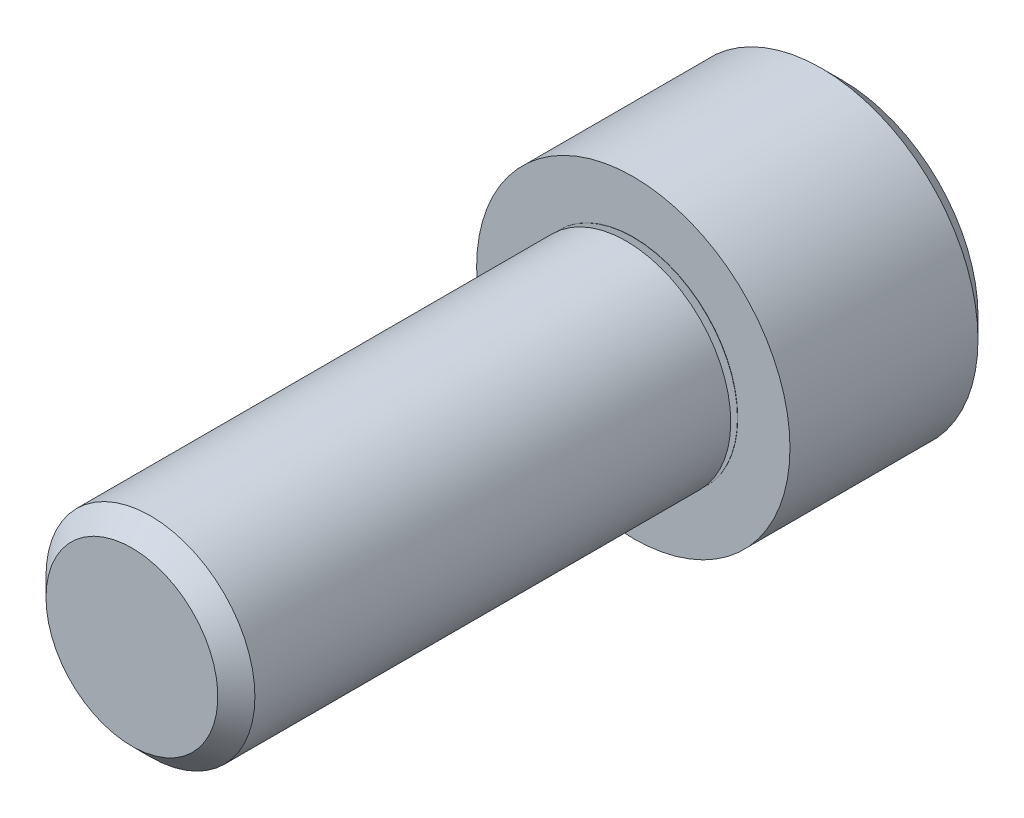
ISO-10303-21;
HEADER;
FILE_DESCRIPTION(('STEP AP214'),'2;1');
FILE_NAME('part.step','',(''),(''),'','','');
FILE_SCHEMA(('AUTOMOTIVE_DESIGN { 1 0 10303 214 1 1 1 1 }'));
ENDSEC;
DATA;
#1=APPLICATION_CONTEXT('core data for automotive mechanical design processes');
#2=APPLICATION_PROTOCOL_DEFINITION('international standard','automotive_design',2000,#1);
#3=PRODUCT_CONTEXT('',#1,'mechanical');
#4=PRODUCT('Part','Part','',(#3));
#5=PRODUCT_RELATED_PRODUCT_CATEGORY('part','',(#4));
#6=PRODUCT_DEFINITION_FORMATION('','',#4);
#7=PRODUCT_DEFINITION_CONTEXT('part definition',#1,'design');
#8=PRODUCT_DEFINITION('design','',#6,#7);
#9=PRODUCT_DEFINITION_SHAPE('','',#8);
#10=(LENGTH_UNIT() NAMED_UNIT(*) SI_UNIT(.MILLI.,.METRE.));
#11=(NAMED_UNIT(*) PLANE_ANGLE_UNIT() SI_UNIT($,.RADIAN.));
#12=(NAMED_UNIT(*) SI_UNIT($,.STERADIAN.) SOLID_ANGLE_UNIT());
#13=UNCERTAINTY_MEASURE_WITH_UNIT(LENGTH_MEASURE(1.E-05),#10,'distance_accuracy_value','');
#14=(GEOMETRIC_REPRESENTATION_CONTEXT(3) GLOBAL_UNCERTAINTY_ASSIGNED_CONTEXT((#13)) GLOBAL_UNIT_ASSIGNED_CONTEXT((#10,
#11,#12)) REPRESENTATION_CONTEXT('',''));
#15=CARTESIAN_POINT('',(0.,0.,0.));
#16=DIRECTION('',(0.,0.,1.));
#17=DIRECTION('',(1.,0.,0.));
#18=AXIS2_PLACEMENT_3D('',#15,#16,#17);
#19=CARTESIAN_POINT('',(0.,0.,-7.9375));
#20=DIRECTION('',(0.,0.,1.));
#21=DIRECTION('',(1.,0.,0.));
#22=AXIS2_PLACEMENT_3D('',#19,#20,#21);
#23=PLANE('',#22);
#24=DIRECTION('',(-0.5,-0.866025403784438,0.));
#25=VECTOR('',#24,1.);
#26=CARTESIAN_POINT('',(3.66617420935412,0.,-7.9375));
#27=LINE('',#26,#25);
#28=CARTESIAN_POINT('',(3.66617420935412,0.,-7.9375));
#29=VERTEX_POINT('',#28);
#30=CARTESIAN_POINT('',(1.83308710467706,-3.17500000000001,-7.9375));
#31=VERTEX_POINT('',#30);
#32=EDGE_CURVE('E145',#29,#31,#27,.T.);
#33=ORIENTED_EDGE('',*,*,#32,.F.);
#34=DIRECTION('',(0.499999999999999,-0.866025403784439,0.));
#35=VECTOR('',#34,1.);
#36=CARTESIAN_POINT('',(1.83308710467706,3.175,-7.9375));
#37=LINE('',#36,#35);
#38=CARTESIAN_POINT('',(1.83308710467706,3.175,-7.9375));
#39=VERTEX_POINT('',#38);
#40=EDGE_CURVE('E64',#39,#29,#37,.T.);
#41=ORIENTED_EDGE('',*,*,#40,.F.);
#42=DIRECTION('',(1.,0.,0.));
#43=VECTOR('',#42,1.);
#44=CARTESIAN_POINT('',(-1.83308710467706,3.175,-7.9375));
#45=LINE('',#44,#43);
#46=CARTESIAN_POINT('',(-1.83308710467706,3.175,-7.9375));
#47=VERTEX_POINT('',#46);
#48=EDGE_CURVE('E158',#47,#39,#45,.T.);
#49=ORIENTED_EDGE('',*,*,#48,.F.);
#50=DIRECTION('',(0.5,0.866025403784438,0.));
#51=VECTOR('',#50,1.);
#52=CARTESIAN_POINT('',(-3.66617420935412,0.,-7.9375));
#53=LINE('',#52,#51);
#54=CARTESIAN_POINT('',(-3.66617420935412,0.,-7.9375));
#55=VERTEX_POINT('',#54);
#56=EDGE_CURVE('E155',#55,#47,#53,.T.);
#57=ORIENTED_EDGE('',*,*,#56,.F.);
#58=DIRECTION('',(-0.5,0.866025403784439,0.));
#59=VECTOR('',#58,1.);
#60=CARTESIAN_POINT('',(-1.83308710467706,-3.17500000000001,-7.9375));
#61=LINE('',#60,#59);
#62=CARTESIAN_POINT('',(-1.83308710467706,-3.17500000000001,-7.9375));
#63=VERTEX_POINT('',#62);
#64=EDGE_CURVE('E112',#63,#55,#61,.T.);
#65=ORIENTED_EDGE('',*,*,#64,.F.);
#66=DIRECTION('',(-1.,0.,0.));
#67=VECTOR('',#66,1.);
#68=CARTESIAN_POINT('',(1.83308710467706,-3.17500000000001,-7.9375));
#69=LINE('',#68,#67);
#70=EDGE_CURVE('E149',#31,#63,#69,.T.);
#71=ORIENTED_EDGE('',*,*,#70,.F.);
#72=EDGE_LOOP('',(#33,#41,#49,#57,#65,#71));
#73=FACE_BOUND('',#72,.T.);
#74=CARTESIAN_POINT('',(0.,0.,-7.9375));
#75=DIRECTION('',(0.,0.,-1.));
#76=DIRECTION('',(-1.,0.,0.));
#77=AXIS2_PLACEMENT_3D('',#74,#75,#76);
#78=CIRCLE('',#77,5.15937500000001);
#79=CARTESIAN_POINT('',(-5.15937500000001,0.,-7.9375));
#80=VERTEX_POINT('',#79);
#81=EDGE_CURVE('E164',#80,#80,#78,.T.);
#82=ORIENTED_EDGE('',*,*,#81,.T.);
#83=EDGE_LOOP('',(#82));
#84=FACE_BOUND('',#83,.T.);
#85=ADVANCED_FACE('F49',(#73,#84),#23,.F.);
#86=CARTESIAN_POINT('',(-3.26390000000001,0.,19.05));
#87=DIRECTION('',(0.,0.,-1.));
#88=DIRECTION('',(-1.,0.,0.));
#89=AXIS2_PLACEMENT_3D('',#86,#87,#88);
#90=PLANE('',#89);
#91=CARTESIAN_POINT('',(0.,0.,19.05));
#92=DIRECTION('',(0.,0.,-1.));
#93=DIRECTION('',(-1.,0.,0.));
#94=AXIS2_PLACEMENT_3D('',#91,#92,#93);
#95=CIRCLE('',#94,3.26390000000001);
#96=CARTESIAN_POINT('',(-3.26390000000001,0.,19.05));
#97=VERTEX_POINT('',#96);
#98=EDGE_CURVE('E11',#97,#97,#95,.T.);
#99=ORIENTED_EDGE('',*,*,#98,.F.);
#100=EDGE_LOOP('',(#99));
#101=FACE_BOUND('',#100,.T.);
#102=ADVANCED_FACE('F214',(#101),#90,.F.);
#103=CARTESIAN_POINT('',(0.,0.,19.05));
#104=DIRECTION('',(0.,0.,-1.));
#105=DIRECTION('',(-1.,0.,0.));
#106=AXIS2_PLACEMENT_3D('',#103,#104,#105);
#107=CONICAL_SURFACE('',#106,3.26390000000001,0.785398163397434);
#108=CARTESIAN_POINT('',(0.,0.,18.34515));
#109=DIRECTION('',(0.,0.,-1.));
#110=DIRECTION('',(-1.,0.,0.));
#111=AXIS2_PLACEMENT_3D('',#108,#109,#110);
#112=CIRCLE('',#111,3.96875000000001);
#113=CARTESIAN_POINT('',(-3.96875000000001,0.,18.34515));
#114=VERTEX_POINT('',#113);
#115=EDGE_CURVE('E57',#114,#114,#112,.T.);
#116=ORIENTED_EDGE('',*,*,#115,.F.);
#117=EDGE_LOOP('',(#116));
#118=FACE_BOUND('',#117,.T.);
#119=ORIENTED_EDGE('',*,*,#98,.T.);
#120=EDGE_LOOP('',(#119));
#121=FACE_BOUND('',#120,.T.);
#122=ADVANCED_FACE('F211',(#118,#121),#107,.T.);
#123=CARTESIAN_POINT('',(0.,0.,-10.585154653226));
#124=DIRECTION('',(0.,0.,-1.));
#125=DIRECTION('',(-1.,0.,0.));
#126=AXIS2_PLACEMENT_3D('',#123,#124,#125);
#127=CYLINDRICAL_SURFACE('',#126,3.96875000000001);
#128=CARTESIAN_POINT('',(0.,0.,0.266544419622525));
#129=DIRECTION('',(0.,0.,-1.));
#130=DIRECTION('',(-1.,0.,0.));
#131=AXIS2_PLACEMENT_3D('',#128,#129,#130);
#132=CIRCLE('',#131,3.96875000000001);
#133=CARTESIAN_POINT('',(-3.96875000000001,0.,0.266544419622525));
#134=VERTEX_POINT('',#133);
#135=EDGE_CURVE('E201',#134,#134,#132,.T.);
#136=ORIENTED_EDGE('',*,*,#135,.F.);
#137=EDGE_LOOP('',(#136));
#138=FACE_BOUND('',#137,.T.);
#139=ORIENTED_EDGE('',*,*,#115,.T.);
#140=EDGE_LOOP('',(#139));
#141=FACE_BOUND('',#140,.T.);
#142=ADVANCED_FACE('F209',(#138,#141),#127,.T.);
#143=CARTESIAN_POINT('',(0.,0.,0.266544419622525));
#144=DIRECTION('',(0.,0.,1.));
#145=DIRECTION('',(1.,0.,0.));
#146=AXIS2_PLACEMENT_3D('',#143,#144,#145);
#147=CONICAL_SURFACE('',#146,3.96875000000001,1.22173047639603);
#148=CARTESIAN_POINT('',(0.,0.,0.0487938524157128));
#149=DIRECTION('',(0.,0.,-1.));
#150=DIRECTION('',(-1.,0.,0.));
#151=AXIS2_PLACEMENT_3D('',#148,#149,#150);
#152=CIRCLE('',#151,3.37048523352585);
#153=CARTESIAN_POINT('',(-3.37048523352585,0.,0.0487938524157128));
#154=VERTEX_POINT('',#153);
#155=EDGE_CURVE('E197',#154,#154,#152,.T.);
#156=ORIENTED_EDGE('',*,*,#155,.F.);
#157=EDGE_LOOP('',(#156));
#158=FACE_BOUND('',#157,.T.);
#159=ORIENTED_EDGE('',*,*,#135,.T.);
#160=EDGE_LOOP('',(#159));
#161=FACE_BOUND('',#160,.T.);
#162=ADVANCED_FACE('F226',(#158,#161),#147,.T.);
#163=CARTESIAN_POINT('',(0.,0.,0.0300000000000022));
#164=DIRECTION('',(0.,0.,-1.));
#165=DIRECTION('',(-1.,0.,0.));
#166=AXIS2_PLACEMENT_3D('',#163,#164,#165);
#167=TOROIDAL_SURFACE('',#166,3.37732563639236,0.0199999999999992);
#168=CARTESIAN_POINT('',(0.,0.,0.0100000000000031));
#169=DIRECTION('',(0.,0.,-1.));
#170=DIRECTION('',(-1.,0.,0.));
#171=AXIS2_PLACEMENT_3D('',#168,#169,#170);
#172=CIRCLE('',#171,3.37732563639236);
#173=CARTESIAN_POINT('',(-3.37732563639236,0.,0.0100000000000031));
#174=VERTEX_POINT('',#173);
#175=EDGE_CURVE('E193',#174,#174,#172,.T.);
#176=ORIENTED_EDGE('',*,*,#175,.F.);
#177=EDGE_LOOP('',(#176));
#178=FACE_BOUND('',#177,.T.);
#179=ORIENTED_EDGE('',*,*,#155,.T.);
#180=EDGE_LOOP('',(#179));
#181=FACE_BOUND('',#180,.T.);
#182=ADVANCED_FACE('F230',(#178,#181),#167,.F.);
#183=CARTESIAN_POINT('',(-3.96875,0.,0.00999999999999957));
#184=DIRECTION('',(0.,0.,-1.));
#185=DIRECTION('',(-1.,0.,0.));
#186=AXIS2_PLACEMENT_3D('',#183,#184,#185);
#187=PLANE('',#186);
#188=CARTESIAN_POINT('',(0.,0.,0.00999999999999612));
#189=DIRECTION('',(0.,0.,-1.));
#190=DIRECTION('',(-1.,0.,0.));
#191=AXIS2_PLACEMENT_3D('',#188,#189,#190);
#192=CIRCLE('',#191,3.96875);
#193=CARTESIAN_POINT('',(-3.96875,0.,0.00999999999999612));
#194=VERTEX_POINT('',#193);
#195=EDGE_CURVE('E189',#194,#194,#192,.T.);
#196=ORIENTED_EDGE('',*,*,#195,.F.);
#197=EDGE_LOOP('',(#196));
#198=FACE_BOUND('',#197,.T.);
#199=ORIENTED_EDGE('',*,*,#175,.T.);
#200=EDGE_LOOP('',(#199));
#201=FACE_BOUND('',#200,.T.);
#202=ADVANCED_FACE('F234',(#198,#201),#187,.F.);
#203=CARTESIAN_POINT('',(0.,0.,-10.585154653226));
#204=DIRECTION('',(0.,0.,-1.));
#205=DIRECTION('',(-1.,0.,0.));
#206=AXIS2_PLACEMENT_3D('',#203,#204,#205);
#207=CYLINDRICAL_SURFACE('',#206,3.96875);
#208=CARTESIAN_POINT('',(0.,0.,0.));
#209=DIRECTION('',(0.,0.,-1.));
#210=DIRECTION('',(-1.,0.,0.));
#211=AXIS2_PLACEMENT_3D('',#208,#209,#210);
#212=CIRCLE('',#211,3.96875);
#213=CARTESIAN_POINT('',(-3.96875,0.,0.));
#214=VERTEX_POINT('',#213);
#215=EDGE_CURVE('E185',#214,#214,#212,.T.);
#216=ORIENTED_EDGE('',*,*,#215,.F.);
#217=EDGE_LOOP('',(#216));
#218=FACE_BOUND('',#217,.T.);
#219=ORIENTED_EDGE('',*,*,#195,.T.);
#220=EDGE_LOOP('',(#219));
#221=FACE_BOUND('',#220,.T.);
#222=ADVANCED_FACE('F238',(#218,#221),#207,.T.);
#223=CARTESIAN_POINT('',(-5.95312500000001,0.,0.));
#224=DIRECTION('',(0.,0.,-1.));
#225=DIRECTION('',(-1.,0.,0.));
#226=AXIS2_PLACEMENT_3D('',#223,#224,#225);
#227=PLANE('',#226);
#228=CARTESIAN_POINT('',(0.,0.,0.));
#229=DIRECTION('',(0.,0.,-1.));
#230=DIRECTION('',(-1.,0.,0.));
#231=AXIS2_PLACEMENT_3D('',#228,#229,#230);
#232=CIRCLE('',#231,5.95312500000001);
#233=CARTESIAN_POINT('',(-5.95312500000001,0.,0.));
#234=VERTEX_POINT('',#233);
#235=EDGE_CURVE('E181',#234,#234,#232,.T.);
#236=ORIENTED_EDGE('',*,*,#235,.F.);
#237=EDGE_LOOP('',(#236));
#238=FACE_BOUND('',#237,.T.);
#239=ORIENTED_EDGE('',*,*,#215,.T.);
#240=EDGE_LOOP('',(#239));
#241=FACE_BOUND('',#240,.T.);
#242=ADVANCED_FACE('F242',(#238,#241),#227,.F.);
#243=CARTESIAN_POINT('',(0.,0.,-10.585154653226));
#244=DIRECTION('',(0.,0.,-1.));
#245=DIRECTION('',(-1.,0.,0.));
#246=AXIS2_PLACEMENT_3D('',#243,#244,#245);
#247=CYLINDRICAL_SURFACE('',#246,5.953125);
#248=CARTESIAN_POINT('',(0.,0.,-7.14375));
#249=DIRECTION('',(0.,0.,-1.));
#250=DIRECTION('',(-1.,0.,0.));
#251=AXIS2_PLACEMENT_3D('',#248,#249,#250);
#252=CIRCLE('',#251,5.953125);
#253=CARTESIAN_POINT('',(-5.953125,0.,-7.14375));
#254=VERTEX_POINT('',#253);
#255=EDGE_CURVE('E177',#254,#254,#252,.T.);
#256=ORIENTED_EDGE('',*,*,#255,.F.);
#257=EDGE_LOOP('',(#256));
#258=FACE_BOUND('',#257,.T.);
#259=ORIENTED_EDGE('',*,*,#235,.T.);
#260=EDGE_LOOP('',(#259));
#261=FACE_BOUND('',#260,.T.);
#262=ADVANCED_FACE('F246',(#258,#261),#247,.T.);
#263=CARTESIAN_POINT('',(0.,0.,-7.14375));
#264=DIRECTION('',(0.,0.,1.));
#265=DIRECTION('',(1.,0.,0.));
#266=AXIS2_PLACEMENT_3D('',#263,#264,#265);
#267=CONICAL_SURFACE('',#266,5.953125,0.785398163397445);
#268=ORIENTED_EDGE('',*,*,#81,.F.);
#269=EDGE_LOOP('',(#268));
#270=FACE_BOUND('',#269,.T.);
#271=ORIENTED_EDGE('',*,*,#255,.T.);
#272=EDGE_LOOP('',(#271));
#273=FACE_BOUND('',#272,.T.);
#274=ADVANCED_FACE('F250',(#270,#273),#267,.T.);
#275=CARTESIAN_POINT('',(1.83308710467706,3.175,-3.96875));
#276=DIRECTION('',(0.866025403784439,0.5,0.));
#277=DIRECTION('',(-0.5,0.866025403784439,0.));
#278=AXIS2_PLACEMENT_3D('',#275,#276,#277);
#279=PLANE('',#278);
#280=ORIENTED_EDGE('',*,*,#40,.T.);
#281=DIRECTION('',(0.,0.,-1.));
#282=VECTOR('',#281,1.);
#283=CARTESIAN_POINT('',(3.66617420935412,0.,-3.96875));
#284=LINE('',#283,#282);
#285=CARTESIAN_POINT('',(3.66617420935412,0.,-3.96875));
#286=VERTEX_POINT('',#285);
#287=EDGE_CURVE('E94',#286,#29,#284,.T.);
#288=ORIENTED_EDGE('',*,*,#287,.F.);
#289=DIRECTION('',(0.499999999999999,-0.866025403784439,0.));
#290=VECTOR('',#289,1.);
#291=CARTESIAN_POINT('',(1.83308710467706,3.175,-3.96875));
#292=LINE('',#291,#290);
#293=CARTESIAN_POINT('',(1.83308710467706,3.175,-3.96875));
#294=VERTEX_POINT('',#293);
#295=EDGE_CURVE('E161',#294,#286,#292,.T.);
#296=ORIENTED_EDGE('',*,*,#295,.F.);
#297=DIRECTION('',(0.,0.,-1.));
#298=VECTOR('',#297,1.);
#299=CARTESIAN_POINT('',(1.83308710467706,3.175,-3.96875));
#300=LINE('',#299,#298);
#301=EDGE_CURVE('E72',#294,#39,#300,.T.);
#302=ORIENTED_EDGE('',*,*,#301,.T.);
#303=EDGE_LOOP('',(#280,#288,#296,#302));
#304=FACE_BOUND('',#303,.T.);
#305=ADVANCED_FACE('F254',(#304),#279,.F.);
#306=CARTESIAN_POINT('',(-1.83308710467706,3.175,-3.96875));
#307=DIRECTION('',(0.,1.,0.));
#308=DIRECTION('',(-1.,0.,0.));
#309=AXIS2_PLACEMENT_3D('',#306,#307,#308);
#310=PLANE('',#309);
#311=ORIENTED_EDGE('',*,*,#48,.T.);
#312=ORIENTED_EDGE('',*,*,#301,.F.);
#313=DIRECTION('',(1.,0.,0.));
#314=VECTOR('',#313,1.);
#315=CARTESIAN_POINT('',(-1.83308710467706,3.175,-3.96875));
#316=LINE('',#315,#314);
#317=CARTESIAN_POINT('',(-1.83308710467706,3.175,-3.96875));
#318=VERTEX_POINT('',#317);
#319=EDGE_CURVE('E126',#318,#294,#316,.T.);
#320=ORIENTED_EDGE('',*,*,#319,.F.);
#321=DIRECTION('',(0.,0.,-1.));
#322=VECTOR('',#321,1.);
#323=CARTESIAN_POINT('',(-1.83308710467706,3.175,-3.96875));
#324=LINE('',#323,#322);
#325=EDGE_CURVE('E117',#318,#47,#324,.T.);
#326=ORIENTED_EDGE('',*,*,#325,.T.);
#327=EDGE_LOOP('',(#311,#312,#320,#326));
#328=FACE_BOUND('',#327,.T.);
#329=ADVANCED_FACE('F258',(#328),#310,.F.);
#330=CARTESIAN_POINT('',(-3.66617420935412,0.,-3.96875));
#331=DIRECTION('',(-0.866025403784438,0.5,0.));
#332=DIRECTION('',(-0.5,-0.866025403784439,0.));
#333=AXIS2_PLACEMENT_3D('',#330,#331,#332);
#334=PLANE('',#333);
#335=ORIENTED_EDGE('',*,*,#56,.T.);
#336=ORIENTED_EDGE('',*,*,#325,.F.);
#337=DIRECTION('',(0.5,0.866025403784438,0.));
#338=VECTOR('',#337,1.);
#339=CARTESIAN_POINT('',(-3.66617420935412,0.,-3.96875));
#340=LINE('',#339,#338);
#341=CARTESIAN_POINT('',(-3.66617420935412,0.,-3.96875));
#342=VERTEX_POINT('',#341);
#343=EDGE_CURVE('E121',#342,#318,#340,.T.);
#344=ORIENTED_EDGE('',*,*,#343,.F.);
#345=DIRECTION('',(0.,0.,-1.));
#346=VECTOR('',#345,1.);
#347=CARTESIAN_POINT('',(-3.66617420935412,0.,-3.96875));
#348=LINE('',#347,#346);
#349=EDGE_CURVE('E105',#342,#55,#348,.T.);
#350=ORIENTED_EDGE('',*,*,#349,.T.);
#351=EDGE_LOOP('',(#335,#336,#344,#350));
#352=FACE_BOUND('',#351,.T.);
#353=ADVANCED_FACE('F122',(#352),#334,.F.);
#354=CARTESIAN_POINT('',(-1.83308710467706,-3.175,-3.96875));
#355=DIRECTION('',(-0.866025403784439,-0.5,0.));
#356=DIRECTION('',(0.5,-0.866025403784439,0.));
#357=AXIS2_PLACEMENT_3D('',#354,#355,#356);
#358=PLANE('',#357);
#359=ORIENTED_EDGE('',*,*,#64,.T.);
#360=ORIENTED_EDGE('',*,*,#349,.F.);
#361=DIRECTION('',(-0.5,0.866025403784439,0.));
#362=VECTOR('',#361,1.);
#363=CARTESIAN_POINT('',(-1.83308710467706,-3.175,-3.96875));
#364=LINE('',#363,#362);
#365=CARTESIAN_POINT('',(-1.83308710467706,-3.175,-3.96875));
#366=VERTEX_POINT('',#365);
#367=EDGE_CURVE('E109',#366,#342,#364,.T.);
#368=ORIENTED_EDGE('',*,*,#367,.F.);
#369=DIRECTION('',(0.,0.,-1.));
#370=VECTOR('',#369,1.);
#371=CARTESIAN_POINT('',(-1.83308710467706,-3.175,-3.96875));
#372=LINE('',#371,#370);
#373=EDGE_CURVE('E118',#366,#63,#372,.T.);
#374=ORIENTED_EDGE('',*,*,#373,.T.);
#375=EDGE_LOOP('',(#359,#360,#368,#374));
#376=FACE_BOUND('',#375,.T.);
#377=ADVANCED_FACE('F107',(#376),#358,.F.);
#378=CARTESIAN_POINT('',(1.83308710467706,-3.175,-3.96875));
#379=DIRECTION('',(0.,-1.,0.));
#380=DIRECTION('',(0.,0.,-1.));
#381=AXIS2_PLACEMENT_3D('',#378,#379,#380);
#382=PLANE('',#381);
#383=ORIENTED_EDGE('',*,*,#70,.T.);
#384=ORIENTED_EDGE('',*,*,#373,.F.);
#385=DIRECTION('',(-1.,0.,0.));
#386=VECTOR('',#385,1.);
#387=CARTESIAN_POINT('',(1.83308710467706,-3.175,-3.96875));
#388=LINE('',#387,#386);
#389=CARTESIAN_POINT('',(1.83308710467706,-3.175,-3.96875));
#390=VERTEX_POINT('',#389);
#391=EDGE_CURVE('E132',#390,#366,#388,.T.);
#392=ORIENTED_EDGE('',*,*,#391,.F.);
#393=DIRECTION('',(0.,0.,-1.));
#394=VECTOR('',#393,1.);
#395=CARTESIAN_POINT('',(1.83308710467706,-3.175,-3.96875));
#396=LINE('',#395,#394);
#397=EDGE_CURVE('E169',#390,#31,#396,.T.);
#398=ORIENTED_EDGE('',*,*,#397,.T.);
#399=EDGE_LOOP('',(#383,#384,#392,#398));
#400=FACE_BOUND('',#399,.T.);
#401=ADVANCED_FACE('F262',(#400),#382,.F.);
#402=CARTESIAN_POINT('',(3.66617420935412,0.,-3.96875));
#403=DIRECTION('',(0.866025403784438,-0.5,0.));
#404=DIRECTION('',(0.5,0.866025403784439,0.));
#405=AXIS2_PLACEMENT_3D('',#402,#403,#404);
#406=PLANE('',#405);
#407=ORIENTED_EDGE('',*,*,#32,.T.);
#408=ORIENTED_EDGE('',*,*,#397,.F.);
#409=DIRECTION('',(-0.5,-0.866025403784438,0.));
#410=VECTOR('',#409,1.);
#411=CARTESIAN_POINT('',(3.66617420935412,0.,-3.96875));
#412=LINE('',#411,#410);
#413=EDGE_CURVE('E137',#286,#390,#412,.T.);
#414=ORIENTED_EDGE('',*,*,#413,.F.);
#415=ORIENTED_EDGE('',*,*,#287,.T.);
#416=EDGE_LOOP('',(#407,#408,#414,#415));
#417=FACE_BOUND('',#416,.T.);
#418=ADVANCED_FACE('F259',(#417),#406,.F.);
#419=CARTESIAN_POINT('',(1.83308710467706,3.175,-3.96875));
#420=DIRECTION('',(0.,0.,1.));
#421=DIRECTION('',(1.,0.,0.));
#422=AXIS2_PLACEMENT_3D('',#419,#420,#421);
#423=PLANE('',#422);
#424=ORIENTED_EDGE('',*,*,#295,.T.);
#425=ORIENTED_EDGE('',*,*,#413,.T.);
#426=ORIENTED_EDGE('',*,*,#391,.T.);
#427=ORIENTED_EDGE('',*,*,#367,.T.);
#428=ORIENTED_EDGE('',*,*,#343,.T.);
#429=ORIENTED_EDGE('',*,*,#319,.T.);
#430=EDGE_LOOP('',(#424,#425,#426,#427,#428,#429));
#431=FACE_BOUND('',#430,.T.);
#432=ADVANCED_FACE('F129',(#431),#423,.F.);
#433=CLOSED_SHELL('',(#85,#102,#122,#142,#162,#182,#202,#222,#242,#262,#274,#305,#329,#353,#377,
#401,#418,#432));
#434=MANIFOLD_SOLID_BREP('B2',#433);
#435=ADVANCED_BREP_SHAPE_REPRESENTATION('',(#18,#434),#14);
#436=SHAPE_DEFINITION_REPRESENTATION(#9,#435);
ENDSEC;
END-ISO-10303-21;
